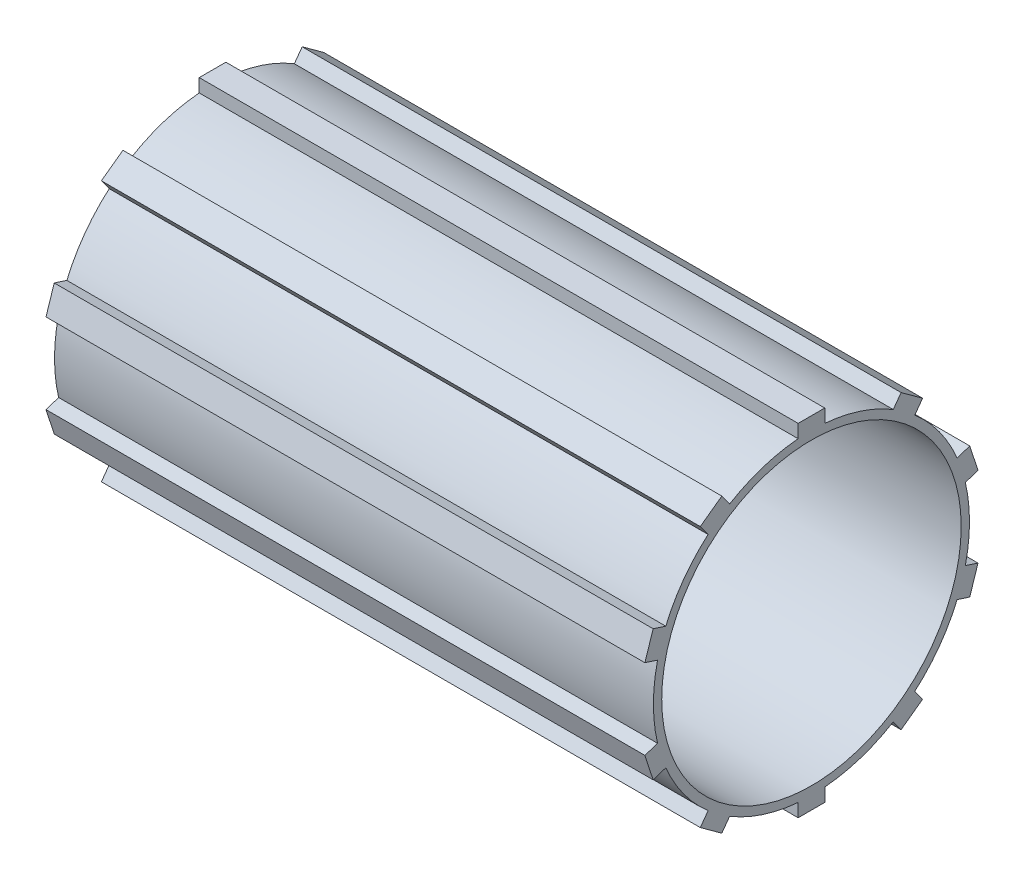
ISO-10303-21;
HEADER;
FILE_DESCRIPTION(('STEP AP214'),'2;1');
FILE_NAME('part.step','',(''),(''),'','','');
FILE_SCHEMA(('AUTOMOTIVE_DESIGN { 1 0 10303 214 1 1 1 1 }'));
ENDSEC;
DATA;
#1=APPLICATION_CONTEXT('core data for automotive mechanical design processes');
#2=APPLICATION_PROTOCOL_DEFINITION('international standard','automotive_design',2000,#1);
#3=PRODUCT_CONTEXT('',#1,'mechanical');
#4=PRODUCT('Part','Part','',(#3));
#5=PRODUCT_RELATED_PRODUCT_CATEGORY('part','',(#4));
#6=PRODUCT_DEFINITION_FORMATION('','',#4);
#7=PRODUCT_DEFINITION_CONTEXT('part definition',#1,'design');
#8=PRODUCT_DEFINITION('design','',#6,#7);
#9=PRODUCT_DEFINITION_SHAPE('','',#8);
#10=(LENGTH_UNIT() NAMED_UNIT(*) SI_UNIT(.MILLI.,.METRE.));
#11=(NAMED_UNIT(*) PLANE_ANGLE_UNIT() SI_UNIT($,.RADIAN.));
#12=(NAMED_UNIT(*) SI_UNIT($,.STERADIAN.) SOLID_ANGLE_UNIT());
#13=UNCERTAINTY_MEASURE_WITH_UNIT(LENGTH_MEASURE(1.E-05),#10,'distance_accuracy_value','');
#14=(GEOMETRIC_REPRESENTATION_CONTEXT(3) GLOBAL_UNCERTAINTY_ASSIGNED_CONTEXT((#13)) GLOBAL_UNIT_ASSIGNED_CONTEXT((#10,
#11,#12)) REPRESENTATION_CONTEXT('',''));
#15=CARTESIAN_POINT('',(0.,0.,0.));
#16=DIRECTION('',(0.,0.,1.));
#17=DIRECTION('',(1.,0.,0.));
#18=AXIS2_PLACEMENT_3D('',#15,#16,#17);
#19=CARTESIAN_POINT('',(90.,0.,0.));
#20=DIRECTION('',(-1.,0.,0.));
#21=DIRECTION('',(0.,0.,1.));
#22=AXIS2_PLACEMENT_3D('',#19,#20,#21);
#23=CYLINDRICAL_SURFACE('',#22,23.75);
#24=DIRECTION('',(-1.,0.,0.));
#25=VECTOR('',#24,1.);
#26=CARTESIAN_POINT('',(90.,20.3214751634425,-12.2922799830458));
#27=LINE('',#26,#25);
#28=CARTESIAN_POINT('',(90.,20.3214751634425,-12.2922799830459));
#29=VERTEX_POINT('',#28);
#30=CARTESIAN_POINT('',(0.,20.3214751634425,-12.2922799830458));
#31=VERTEX_POINT('',#30);
#32=EDGE_CURVE('E341',#29,#31,#27,.T.);
#33=ORIENTED_EDGE('',*,*,#32,.T.);
#34=CARTESIAN_POINT('',(0.,0.,0.));
#35=DIRECTION('',(1.,0.,0.));
#36=DIRECTION('',(0.,0.,-1.));
#37=AXIS2_PLACEMENT_3D('',#34,#35,#36);
#38=CIRCLE('',#37,23.75);
#39=CARTESIAN_POINT('',(0.,23.6656396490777,-2.));
#40=VERTEX_POINT('',#39);
#41=EDGE_CURVE('E690',#31,#40,#38,.T.);
#42=ORIENTED_EDGE('',*,*,#41,.T.);
#43=DIRECTION('',(-1.,0.,0.));
#44=VECTOR('',#43,1.);
#45=CARTESIAN_POINT('',(90.,23.6656396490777,-2.));
#46=LINE('',#45,#44);
#47=CARTESIAN_POINT('',(90.,23.6656396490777,-2.));
#48=VERTEX_POINT('',#47);
#49=EDGE_CURVE('E677',#48,#40,#46,.T.);
#50=ORIENTED_EDGE('',*,*,#49,.F.);
#51=CARTESIAN_POINT('',(90.,0.,0.));
#52=DIRECTION('',(1.,0.,0.));
#53=DIRECTION('',(0.,0.,-1.));
#54=AXIS2_PLACEMENT_3D('',#51,#52,#53);
#55=CIRCLE('',#54,23.75);
#56=EDGE_CURVE('E50',#29,#48,#55,.T.);
#57=ORIENTED_EDGE('',*,*,#56,.F.);
#58=EDGE_LOOP('',(#33,#42,#50,#57));
#59=FACE_BOUND('',#58,.T.);
#60=ADVANCED_FACE('F39',(#59),#23,.T.);
#61=CARTESIAN_POINT('',(0.,9.21519786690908,-21.8893268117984));
#62=VERTEX_POINT('',#61);
#63=CARTESIAN_POINT('',(0.,17.9703341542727,-15.5283479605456));
#64=VERTEX_POINT('',#63);
#65=EDGE_CURVE('E750',#62,#64,#38,.T.);
#66=ORIENTED_EDGE('',*,*,#65,.T.);
#67=DIRECTION('',(-1.,0.,0.));
#68=VECTOR('',#67,1.);
#69=CARTESIAN_POINT('',(90.,17.9703341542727,-15.5283479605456));
#70=LINE('',#69,#68);
#71=CARTESIAN_POINT('',(90.,17.9703341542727,-15.5283479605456));
#72=VERTEX_POINT('',#71);
#73=EDGE_CURVE('E64',#72,#64,#70,.T.);
#74=ORIENTED_EDGE('',*,*,#73,.F.);
#75=CARTESIAN_POINT('',(90.,9.2151978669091,-21.8893268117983));
#76=VERTEX_POINT('',#75);
#77=EDGE_CURVE('E318',#76,#72,#55,.T.);
#78=ORIENTED_EDGE('',*,*,#77,.F.);
#79=DIRECTION('',(-1.,0.,0.));
#80=VECTOR('',#79,1.);
#81=CARTESIAN_POINT('',(90.,9.21519786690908,-21.8893268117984));
#82=LINE('',#81,#80);
#83=EDGE_CURVE('E377',#76,#62,#82,.T.);
#84=ORIENTED_EDGE('',*,*,#83,.T.);
#85=EDGE_LOOP('',(#66,#74,#78,#84));
#86=FACE_BOUND('',#85,.T.);
#87=ADVANCED_FACE('F712',(#86),#23,.T.);
#88=CARTESIAN_POINT('',(0.,-5.4109718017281,-23.1253947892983));
#89=VERTEX_POINT('',#88);
#90=CARTESIAN_POINT('',(0.,5.41097180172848,-23.1253947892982));
#91=VERTEX_POINT('',#90);
#92=EDGE_CURVE('E872',#89,#91,#38,.T.);
#93=ORIENTED_EDGE('',*,*,#92,.T.);
#94=DIRECTION('',(-1.,0.,0.));
#95=VECTOR('',#94,1.);
#96=CARTESIAN_POINT('',(90.,5.41097180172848,-23.1253947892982));
#97=LINE('',#96,#95);
#98=CARTESIAN_POINT('',(90.,5.41097180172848,-23.1253947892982));
#99=VERTEX_POINT('',#98);
#100=EDGE_CURVE('E373',#99,#91,#97,.T.);
#101=ORIENTED_EDGE('',*,*,#100,.F.);
#102=CARTESIAN_POINT('',(90.,-5.41097180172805,-23.1253947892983));
#103=VERTEX_POINT('',#102);
#104=EDGE_CURVE('E757',#103,#99,#55,.T.);
#105=ORIENTED_EDGE('',*,*,#104,.F.);
#106=DIRECTION('',(-1.,0.,0.));
#107=VECTOR('',#106,1.);
#108=CARTESIAN_POINT('',(90.,-5.4109718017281,-23.1253947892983));
#109=LINE('',#108,#107);
#110=EDGE_CURVE('E415',#103,#89,#109,.T.);
#111=ORIENTED_EDGE('',*,*,#110,.T.);
#112=EDGE_LOOP('',(#93,#101,#105,#111));
#113=FACE_BOUND('',#112,.T.);
#114=ADVANCED_FACE('F716',(#113),#23,.T.);
#115=CARTESIAN_POINT('',(0.,-17.9703341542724,-15.5283479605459));
#116=VERTEX_POINT('',#115);
#117=CARTESIAN_POINT('',(0.,-9.21519786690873,-21.8893268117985));
#118=VERTEX_POINT('',#117);
#119=EDGE_CURVE('E858',#116,#118,#38,.T.);
#120=ORIENTED_EDGE('',*,*,#119,.T.);
#121=DIRECTION('',(-1.,0.,0.));
#122=VECTOR('',#121,1.);
#123=CARTESIAN_POINT('',(90.,-9.21519786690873,-21.8893268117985));
#124=LINE('',#123,#122);
#125=CARTESIAN_POINT('',(90.,-9.21519786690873,-21.8893268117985));
#126=VERTEX_POINT('',#125);
#127=EDGE_CURVE('E411',#126,#118,#124,.T.);
#128=ORIENTED_EDGE('',*,*,#127,.F.);
#129=CARTESIAN_POINT('',(90.,-17.9703341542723,-15.528347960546));
#130=VERTEX_POINT('',#129);
#131=EDGE_CURVE('E760',#130,#126,#55,.T.);
#132=ORIENTED_EDGE('',*,*,#131,.F.);
#133=DIRECTION('',(-1.,0.,0.));
#134=VECTOR('',#133,1.);
#135=CARTESIAN_POINT('',(90.,-17.9703341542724,-15.5283479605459));
#136=LINE('',#135,#134);
#137=EDGE_CURVE('E453',#130,#116,#136,.T.);
#138=ORIENTED_EDGE('',*,*,#137,.T.);
#139=EDGE_LOOP('',(#120,#128,#132,#138));
#140=FACE_BOUND('',#139,.T.);
#141=ADVANCED_FACE('F857',(#140),#23,.T.);
#142=CARTESIAN_POINT('',(0.,-23.6656396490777,-2.00000000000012));
#143=VERTEX_POINT('',#142);
#144=CARTESIAN_POINT('',(0.,-20.3214751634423,-12.2922799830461));
#145=VERTEX_POINT('',#144);
#146=EDGE_CURVE('E843',#143,#145,#38,.T.);
#147=ORIENTED_EDGE('',*,*,#146,.T.);
#148=DIRECTION('',(-1.,0.,0.));
#149=VECTOR('',#148,1.);
#150=CARTESIAN_POINT('',(90.,-20.3214751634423,-12.2922799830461));
#151=LINE('',#150,#149);
#152=CARTESIAN_POINT('',(90.,-20.3214751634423,-12.2922799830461));
#153=VERTEX_POINT('',#152);
#154=EDGE_CURVE('E449',#153,#145,#151,.T.);
#155=ORIENTED_EDGE('',*,*,#154,.F.);
#156=CARTESIAN_POINT('',(90.,-23.6656396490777,-2.00000000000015));
#157=VERTEX_POINT('',#156);
#158=EDGE_CURVE('E764',#157,#153,#55,.T.);
#159=ORIENTED_EDGE('',*,*,#158,.F.);
#160=DIRECTION('',(-1.,0.,0.));
#161=VECTOR('',#160,1.);
#162=CARTESIAN_POINT('',(90.,-23.6656396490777,-2.00000000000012));
#163=LINE('',#162,#161);
#164=EDGE_CURVE('E491',#157,#143,#163,.T.);
#165=ORIENTED_EDGE('',*,*,#164,.T.);
#166=EDGE_LOOP('',(#147,#155,#159,#165));
#167=FACE_BOUND('',#166,.T.);
#168=ADVANCED_FACE('F842',(#167),#23,.T.);
#169=CARTESIAN_POINT('',(0.,-20.3214751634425,12.2922799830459));
#170=VERTEX_POINT('',#169);
#171=CARTESIAN_POINT('',(0.,-23.6656396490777,1.99999999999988));
#172=VERTEX_POINT('',#171);
#173=EDGE_CURVE('E828',#170,#172,#38,.T.);
#174=ORIENTED_EDGE('',*,*,#173,.T.);
#175=DIRECTION('',(-1.,0.,0.));
#176=VECTOR('',#175,1.);
#177=CARTESIAN_POINT('',(90.,-23.6656396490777,1.99999999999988));
#178=LINE('',#177,#176);
#179=CARTESIAN_POINT('',(90.,-23.6656396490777,1.99999999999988));
#180=VERTEX_POINT('',#179);
#181=EDGE_CURVE('E487',#180,#172,#178,.T.);
#182=ORIENTED_EDGE('',*,*,#181,.F.);
#183=CARTESIAN_POINT('',(90.,-20.3214751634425,12.2922799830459));
#184=VERTEX_POINT('',#183);
#185=EDGE_CURVE('E768',#184,#180,#55,.T.);
#186=ORIENTED_EDGE('',*,*,#185,.F.);
#187=DIRECTION('',(-1.,0.,0.));
#188=VECTOR('',#187,1.);
#189=CARTESIAN_POINT('',(90.,-20.3214751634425,12.2922799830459));
#190=LINE('',#189,#188);
#191=EDGE_CURVE('E529',#184,#170,#190,.T.);
#192=ORIENTED_EDGE('',*,*,#191,.T.);
#193=EDGE_LOOP('',(#174,#182,#186,#192));
#194=FACE_BOUND('',#193,.T.);
#195=ADVANCED_FACE('F827',(#194),#23,.T.);
#196=CARTESIAN_POINT('',(0.,-9.21519786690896,21.8893268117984));
#197=VERTEX_POINT('',#196);
#198=CARTESIAN_POINT('',(0.,-17.9703341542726,15.5283479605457));
#199=VERTEX_POINT('',#198);
#200=EDGE_CURVE('E813',#197,#199,#38,.T.);
#201=ORIENTED_EDGE('',*,*,#200,.T.);
#202=DIRECTION('',(-1.,0.,0.));
#203=VECTOR('',#202,1.);
#204=CARTESIAN_POINT('',(90.,-17.9703341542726,15.5283479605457));
#205=LINE('',#204,#203);
#206=CARTESIAN_POINT('',(90.,-17.9703341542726,15.5283479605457));
#207=VERTEX_POINT('',#206);
#208=EDGE_CURVE('E525',#207,#199,#205,.T.);
#209=ORIENTED_EDGE('',*,*,#208,.F.);
#210=CARTESIAN_POINT('',(90.,-9.21519786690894,21.8893268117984));
#211=VERTEX_POINT('',#210);
#212=EDGE_CURVE('E772',#211,#207,#55,.T.);
#213=ORIENTED_EDGE('',*,*,#212,.F.);
#214=DIRECTION('',(-1.,0.,0.));
#215=VECTOR('',#214,1.);
#216=CARTESIAN_POINT('',(90.,-9.21519786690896,21.8893268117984));
#217=LINE('',#216,#215);
#218=EDGE_CURVE('E567',#211,#197,#217,.T.);
#219=ORIENTED_EDGE('',*,*,#218,.T.);
#220=EDGE_LOOP('',(#201,#209,#213,#219));
#221=FACE_BOUND('',#220,.T.);
#222=ADVANCED_FACE('F812',(#221),#23,.T.);
#223=CARTESIAN_POINT('',(0.,5.41097180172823,23.1253947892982));
#224=VERTEX_POINT('',#223);
#225=CARTESIAN_POINT('',(0.,-5.41097180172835,23.1253947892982));
#226=VERTEX_POINT('',#225);
#227=EDGE_CURVE('E798',#224,#226,#38,.T.);
#228=ORIENTED_EDGE('',*,*,#227,.T.);
#229=DIRECTION('',(-1.,0.,0.));
#230=VECTOR('',#229,1.);
#231=CARTESIAN_POINT('',(90.,-5.41097180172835,23.1253947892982));
#232=LINE('',#231,#230);
#233=CARTESIAN_POINT('',(90.,-5.41097180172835,23.1253947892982));
#234=VERTEX_POINT('',#233);
#235=EDGE_CURVE('E563',#234,#226,#232,.T.);
#236=ORIENTED_EDGE('',*,*,#235,.F.);
#237=CARTESIAN_POINT('',(90.,5.41097180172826,23.1253947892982));
#238=VERTEX_POINT('',#237);
#239=EDGE_CURVE('E776',#238,#234,#55,.T.);
#240=ORIENTED_EDGE('',*,*,#239,.F.);
#241=DIRECTION('',(-1.,0.,0.));
#242=VECTOR('',#241,1.);
#243=CARTESIAN_POINT('',(90.,5.41097180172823,23.1253947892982));
#244=LINE('',#243,#242);
#245=EDGE_CURVE('E605',#238,#224,#244,.T.);
#246=ORIENTED_EDGE('',*,*,#245,.T.);
#247=EDGE_LOOP('',(#228,#236,#240,#246));
#248=FACE_BOUND('',#247,.T.);
#249=ADVANCED_FACE('F724',(#248),#23,.T.);
#250=CARTESIAN_POINT('',(0.,17.9703341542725,15.5283479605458));
#251=VERTEX_POINT('',#250);
#252=CARTESIAN_POINT('',(0.,9.21519786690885,21.8893268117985));
#253=VERTEX_POINT('',#252);
#254=EDGE_CURVE('E729',#251,#253,#38,.T.);
#255=ORIENTED_EDGE('',*,*,#254,.T.);
#256=DIRECTION('',(-1.,0.,0.));
#257=VECTOR('',#256,1.);
#258=CARTESIAN_POINT('',(90.,9.21519786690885,21.8893268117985));
#259=LINE('',#258,#257);
#260=CARTESIAN_POINT('',(90.,9.21519786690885,21.8893268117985));
#261=VERTEX_POINT('',#260);
#262=EDGE_CURVE('E601',#261,#253,#259,.T.);
#263=ORIENTED_EDGE('',*,*,#262,.F.);
#264=CARTESIAN_POINT('',(90.,17.9703341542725,15.5283479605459));
#265=VERTEX_POINT('',#264);
#266=EDGE_CURVE('E49',#265,#261,#55,.T.);
#267=ORIENTED_EDGE('',*,*,#266,.F.);
#268=DIRECTION('',(-1.,0.,0.));
#269=VECTOR('',#268,1.);
#270=CARTESIAN_POINT('',(90.,17.9703341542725,15.5283479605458));
#271=LINE('',#270,#269);
#272=EDGE_CURVE('E643',#265,#251,#271,.T.);
#273=ORIENTED_EDGE('',*,*,#272,.T.);
#274=EDGE_LOOP('',(#255,#263,#267,#273));
#275=FACE_BOUND('',#274,.T.);
#276=ADVANCED_FACE('F718',(#275),#23,.T.);
#277=CARTESIAN_POINT('',(0.,23.6656396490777,2.));
#278=VERTEX_POINT('',#277);
#279=CARTESIAN_POINT('',(0.,20.3214751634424,12.292279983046));
#280=VERTEX_POINT('',#279);
#281=EDGE_CURVE('E43',#278,#280,#38,.T.);
#282=ORIENTED_EDGE('',*,*,#281,.T.);
#283=DIRECTION('',(-1.,0.,0.));
#284=VECTOR('',#283,1.);
#285=CARTESIAN_POINT('',(90.,20.3214751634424,12.292279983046));
#286=LINE('',#285,#284);
#287=CARTESIAN_POINT('',(90.,20.3214751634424,12.292279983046));
#288=VERTEX_POINT('',#287);
#289=EDGE_CURVE('E639',#288,#280,#286,.T.);
#290=ORIENTED_EDGE('',*,*,#289,.F.);
#291=CARTESIAN_POINT('',(90.,23.6656396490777,2.00000000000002));
#292=VERTEX_POINT('',#291);
#293=EDGE_CURVE('E11',#292,#288,#55,.T.);
#294=ORIENTED_EDGE('',*,*,#293,.F.);
#295=DIRECTION('',(-1.,0.,0.));
#296=VECTOR('',#295,1.);
#297=CARTESIAN_POINT('',(90.,23.6656396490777,2.));
#298=LINE('',#297,#296);
#299=EDGE_CURVE('E681',#292,#278,#298,.T.);
#300=ORIENTED_EDGE('',*,*,#299,.T.);
#301=EDGE_LOOP('',(#282,#290,#294,#300));
#302=FACE_BOUND('',#301,.T.);
#303=ADVANCED_FACE('F41',(#302),#23,.T.);
#304=CARTESIAN_POINT('',(90.,0.,0.));
#305=DIRECTION('',(1.,0.,0.));
#306=DIRECTION('',(0.,0.,-1.));
#307=AXIS2_PLACEMENT_3D('',#304,#305,#306);
#308=PLANE('',#307);
#309=ORIENTED_EDGE('',*,*,#77,.T.);
#310=DIRECTION('',(0.,-0.809016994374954,0.587785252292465));
#311=VECTOR('',#310,1.);
#312=CARTESIAN_POINT('',(90.,19.5883681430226,-16.7039184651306));
#313=LINE('',#312,#311);
#314=CARTESIAN_POINT('',(90.,19.5883681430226,-16.7039184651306));
#315=VERTEX_POINT('',#314);
#316=EDGE_CURVE('E302',#315,#72,#313,.T.);
#317=ORIENTED_EDGE('',*,*,#316,.F.);
#318=DIRECTION('',(0.,-0.587785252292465,-0.809016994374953));
#319=VECTOR('',#318,1.);
#320=CARTESIAN_POINT('',(90.,21.9395091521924,-13.4678504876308));
#321=LINE('',#320,#319);
#322=CARTESIAN_POINT('',(90.,21.9395091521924,-13.4678504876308));
#323=VERTEX_POINT('',#322);
#324=EDGE_CURVE('E316',#323,#315,#321,.T.);
#325=ORIENTED_EDGE('',*,*,#324,.F.);
#326=DIRECTION('',(0.,-0.809016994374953,0.587785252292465));
#327=VECTOR('',#326,1.);
#328=CARTESIAN_POINT('',(90.,21.9395091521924,-13.4678504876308));
#329=LINE('',#328,#327);
#330=EDGE_CURVE('E320',#323,#29,#329,.T.);
#331=ORIENTED_EDGE('',*,*,#330,.T.);
#332=ORIENTED_EDGE('',*,*,#56,.T.);
#333=DIRECTION('',(0.,-1.,0.));
#334=VECTOR('',#333,1.);
#335=CARTESIAN_POINT('',(90.,25.6656396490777,-2.));
#336=LINE('',#335,#334);
#337=CARTESIAN_POINT('',(90.,25.6656396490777,-2.));
#338=VERTEX_POINT('',#337);
#339=EDGE_CURVE('E652',#338,#48,#336,.T.);
#340=ORIENTED_EDGE('',*,*,#339,.F.);
#341=DIRECTION('',(0.,0.,-1.));
#342=VECTOR('',#341,1.);
#343=CARTESIAN_POINT('',(90.,25.6656396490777,2.));
#344=LINE('',#343,#342);
#345=CARTESIAN_POINT('',(90.,25.6656396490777,2.));
#346=VERTEX_POINT('',#345);
#347=EDGE_CURVE('E657',#346,#338,#344,.T.);
#348=ORIENTED_EDGE('',*,*,#347,.F.);
#349=DIRECTION('',(0.,-1.,0.));
#350=VECTOR('',#349,1.);
#351=CARTESIAN_POINT('',(90.,25.6656396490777,2.));
#352=LINE('',#351,#350);
#353=EDGE_CURVE('E648',#346,#292,#352,.T.);
#354=ORIENTED_EDGE('',*,*,#353,.T.);
#355=ORIENTED_EDGE('',*,*,#293,.T.);
#356=DIRECTION('',(0.,-0.809016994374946,-0.587785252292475));
#357=VECTOR('',#356,1.);
#358=CARTESIAN_POINT('',(90.,21.9395091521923,13.467850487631));
#359=LINE('',#358,#357);
#360=CARTESIAN_POINT('',(90.,21.9395091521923,13.467850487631));
#361=VERTEX_POINT('',#360);
#362=EDGE_CURVE('E614',#361,#288,#359,.T.);
#363=ORIENTED_EDGE('',*,*,#362,.F.);
#364=DIRECTION('',(0.,0.587785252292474,-0.809016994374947));
#365=VECTOR('',#364,1.);
#366=CARTESIAN_POINT('',(90.,19.5883681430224,16.7039184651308));
#367=LINE('',#366,#365);
#368=CARTESIAN_POINT('',(90.,19.5883681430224,16.7039184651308));
#369=VERTEX_POINT('',#368);
#370=EDGE_CURVE('E619',#369,#361,#367,.T.);
#371=ORIENTED_EDGE('',*,*,#370,.F.);
#372=DIRECTION('',(0.,-0.809016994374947,-0.587785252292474));
#373=VECTOR('',#372,1.);
#374=CARTESIAN_POINT('',(90.,19.5883681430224,16.7039184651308));
#375=LINE('',#374,#373);
#376=EDGE_CURVE('E610',#369,#265,#375,.T.);
#377=ORIENTED_EDGE('',*,*,#376,.T.);
#378=ORIENTED_EDGE('',*,*,#266,.T.);
#379=DIRECTION('',(0.,-0.309016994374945,-0.951056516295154));
#380=VECTOR('',#379,1.);
#381=CARTESIAN_POINT('',(90.,9.83323185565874,23.7914398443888));
#382=LINE('',#381,#380);
#383=CARTESIAN_POINT('',(90.,9.83323185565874,23.7914398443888));
#384=VERTEX_POINT('',#383);
#385=EDGE_CURVE('E576',#384,#261,#382,.T.);
#386=ORIENTED_EDGE('',*,*,#385,.F.);
#387=DIRECTION('',(0.,0.951056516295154,-0.309016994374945));
#388=VECTOR('',#387,1.);
#389=CARTESIAN_POINT('',(90.,6.02900579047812,25.0275078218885));
#390=LINE('',#389,#388);
#391=CARTESIAN_POINT('',(90.,6.02900579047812,25.0275078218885));
#392=VERTEX_POINT('',#391);
#393=EDGE_CURVE('E581',#392,#384,#390,.T.);
#394=ORIENTED_EDGE('',*,*,#393,.F.);
#395=DIRECTION('',(0.,-0.309016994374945,-0.951056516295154));
#396=VECTOR('',#395,1.);
#397=CARTESIAN_POINT('',(90.,6.02900579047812,25.0275078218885));
#398=LINE('',#397,#396);
#399=EDGE_CURVE('E572',#392,#238,#398,.T.);
#400=ORIENTED_EDGE('',*,*,#399,.T.);
#401=ORIENTED_EDGE('',*,*,#239,.T.);
#402=DIRECTION('',(0.,0.309016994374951,-0.951056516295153));
#403=VECTOR('',#402,1.);
#404=CARTESIAN_POINT('',(90.,-6.02900579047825,25.0275078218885));
#405=LINE('',#404,#403);
#406=CARTESIAN_POINT('',(90.,-6.02900579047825,25.0275078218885));
#407=VERTEX_POINT('',#406);
#408=EDGE_CURVE('E538',#407,#234,#405,.T.);
#409=ORIENTED_EDGE('',*,*,#408,.F.);
#410=DIRECTION('',(0.,0.951056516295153,0.309016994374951));
#411=VECTOR('',#410,1.);
#412=CARTESIAN_POINT('',(90.,-9.83323185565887,23.7914398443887));
#413=LINE('',#412,#411);
#414=CARTESIAN_POINT('',(90.,-9.83323185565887,23.7914398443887));
#415=VERTEX_POINT('',#414);
#416=EDGE_CURVE('E543',#415,#407,#413,.T.);
#417=ORIENTED_EDGE('',*,*,#416,.F.);
#418=DIRECTION('',(0.,0.309016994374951,-0.951056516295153));
#419=VECTOR('',#418,1.);
#420=CARTESIAN_POINT('',(90.,-9.83323185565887,23.7914398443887));
#421=LINE('',#420,#419);
#422=EDGE_CURVE('E534',#415,#211,#421,.T.);
#423=ORIENTED_EDGE('',*,*,#422,.T.);
#424=ORIENTED_EDGE('',*,*,#212,.T.);
#425=DIRECTION('',(0.,0.80901699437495,-0.587785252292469));
#426=VECTOR('',#425,1.);
#427=CARTESIAN_POINT('',(90.,-19.5883681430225,16.7039184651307));
#428=LINE('',#427,#426);
#429=CARTESIAN_POINT('',(90.,-19.5883681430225,16.7039184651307));
#430=VERTEX_POINT('',#429);
#431=EDGE_CURVE('E500',#430,#207,#428,.T.);
#432=ORIENTED_EDGE('',*,*,#431,.F.);
#433=DIRECTION('',(0.,0.58778525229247,0.80901699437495));
#434=VECTOR('',#433,1.);
#435=CARTESIAN_POINT('',(90.,-21.9395091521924,13.4678504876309));
#436=LINE('',#435,#434);
#437=CARTESIAN_POINT('',(90.,-21.9395091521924,13.4678504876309));
#438=VERTEX_POINT('',#437);
#439=EDGE_CURVE('E505',#438,#430,#436,.T.);
#440=ORIENTED_EDGE('',*,*,#439,.F.);
#441=DIRECTION('',(0.,0.80901699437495,-0.587785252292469));
#442=VECTOR('',#441,1.);
#443=CARTESIAN_POINT('',(90.,-21.9395091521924,13.4678504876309));
#444=LINE('',#443,#442);
#445=EDGE_CURVE('E496',#438,#184,#444,.T.);
#446=ORIENTED_EDGE('',*,*,#445,.T.);
#447=ORIENTED_EDGE('',*,*,#185,.T.);
#448=DIRECTION('',(0.,1.,0.));
#449=VECTOR('',#448,1.);
#450=CARTESIAN_POINT('',(90.,-25.6656396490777,1.99999999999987));
#451=LINE('',#450,#449);
#452=CARTESIAN_POINT('',(90.,-25.6656396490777,1.99999999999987));
#453=VERTEX_POINT('',#452);
#454=EDGE_CURVE('E462',#453,#180,#451,.T.);
#455=ORIENTED_EDGE('',*,*,#454,.F.);
#456=DIRECTION('',(0.,0.,1.));
#457=VECTOR('',#456,1.);
#458=CARTESIAN_POINT('',(90.,-25.6656396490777,-2.00000000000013));
#459=LINE('',#458,#457);
#460=CARTESIAN_POINT('',(90.,-25.6656396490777,-2.00000000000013));
#461=VERTEX_POINT('',#460);
#462=EDGE_CURVE('E467',#461,#453,#459,.T.);
#463=ORIENTED_EDGE('',*,*,#462,.F.);
#464=DIRECTION('',(0.,1.,0.));
#465=VECTOR('',#464,1.);
#466=CARTESIAN_POINT('',(90.,-25.6656396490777,-2.00000000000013));
#467=LINE('',#466,#465);
#468=EDGE_CURVE('E458',#461,#157,#467,.T.);
#469=ORIENTED_EDGE('',*,*,#468,.T.);
#470=ORIENTED_EDGE('',*,*,#158,.T.);
#471=DIRECTION('',(0.,0.809016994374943,0.587785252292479));
#472=VECTOR('',#471,1.);
#473=CARTESIAN_POINT('',(90.,-21.9395091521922,-13.4678504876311));
#474=LINE('',#473,#472);
#475=CARTESIAN_POINT('',(90.,-21.9395091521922,-13.4678504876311));
#476=VERTEX_POINT('',#475);
#477=EDGE_CURVE('E424',#476,#153,#474,.T.);
#478=ORIENTED_EDGE('',*,*,#477,.F.);
#479=DIRECTION('',(0.,-0.587785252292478,0.809016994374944));
#480=VECTOR('',#479,1.);
#481=CARTESIAN_POINT('',(90.,-19.5883681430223,-16.7039184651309));
#482=LINE('',#481,#480);
#483=CARTESIAN_POINT('',(90.,-19.5883681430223,-16.7039184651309));
#484=VERTEX_POINT('',#483);
#485=EDGE_CURVE('E429',#484,#476,#482,.T.);
#486=ORIENTED_EDGE('',*,*,#485,.F.);
#487=DIRECTION('',(0.,0.809016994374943,0.587785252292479));
#488=VECTOR('',#487,1.);
#489=CARTESIAN_POINT('',(90.,-19.5883681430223,-16.7039184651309));
#490=LINE('',#489,#488);
#491=EDGE_CURVE('E420',#484,#130,#490,.T.);
#492=ORIENTED_EDGE('',*,*,#491,.T.);
#493=ORIENTED_EDGE('',*,*,#131,.T.);
#494=DIRECTION('',(0.,0.309016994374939,0.951056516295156));
#495=VECTOR('',#494,1.);
#496=CARTESIAN_POINT('',(90.,-9.83323185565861,-23.7914398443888));
#497=LINE('',#496,#495);
#498=CARTESIAN_POINT('',(90.,-9.83323185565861,-23.7914398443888));
#499=VERTEX_POINT('',#498);
#500=EDGE_CURVE('E386',#499,#126,#497,.T.);
#501=ORIENTED_EDGE('',*,*,#500,.F.);
#502=DIRECTION('',(0.,-0.951056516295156,0.30901699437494));
#503=VECTOR('',#502,1.);
#504=CARTESIAN_POINT('',(90.,-6.02900579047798,-25.0275078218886));
#505=LINE('',#504,#503);
#506=CARTESIAN_POINT('',(90.,-6.02900579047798,-25.0275078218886));
#507=VERTEX_POINT('',#506);
#508=EDGE_CURVE('E391',#507,#499,#505,.T.);
#509=ORIENTED_EDGE('',*,*,#508,.F.);
#510=DIRECTION('',(0.,0.30901699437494,0.951056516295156));
#511=VECTOR('',#510,1.);
#512=CARTESIAN_POINT('',(90.,-6.02900579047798,-25.0275078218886));
#513=LINE('',#512,#511);
#514=EDGE_CURVE('E382',#507,#103,#513,.T.);
#515=ORIENTED_EDGE('',*,*,#514,.T.);
#516=ORIENTED_EDGE('',*,*,#104,.T.);
#517=DIRECTION('',(0.,-0.309016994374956,0.951056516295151));
#518=VECTOR('',#517,1.);
#519=CARTESIAN_POINT('',(90.,6.02900579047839,-25.0275078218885));
#520=LINE('',#519,#518);
#521=CARTESIAN_POINT('',(90.,6.02900579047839,-25.0275078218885));
#522=VERTEX_POINT('',#521);
#523=EDGE_CURVE('E348',#522,#99,#520,.T.);
#524=ORIENTED_EDGE('',*,*,#523,.F.);
#525=DIRECTION('',(0.,-0.951056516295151,-0.309016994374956));
#526=VECTOR('',#525,1.);
#527=CARTESIAN_POINT('',(90.,9.83323185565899,-23.7914398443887));
#528=LINE('',#527,#526);
#529=CARTESIAN_POINT('',(90.,9.83323185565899,-23.7914398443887));
#530=VERTEX_POINT('',#529);
#531=EDGE_CURVE('E353',#530,#522,#528,.T.);
#532=ORIENTED_EDGE('',*,*,#531,.F.);
#533=DIRECTION('',(0.,-0.309016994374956,0.951056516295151));
#534=VECTOR('',#533,1.);
#535=CARTESIAN_POINT('',(90.,9.83323185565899,-23.7914398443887));
#536=LINE('',#535,#534);
#537=EDGE_CURVE('E345',#530,#76,#536,.T.);
#538=ORIENTED_EDGE('',*,*,#537,.T.);
#539=EDGE_LOOP('',(#309,#317,#325,#331,#332,#340,#348,#354,#355,#363,#371,#377,#378,#386,#394,
#400,#401,#409,#417,#423,#424,#432,#440,#446,#447,#455,#463,#469,#470,#478,#486,#492,#493,#501,
#509,#515,#516,#524,#532,#538));
#540=FACE_BOUND('',#539,.T.);
#541=CARTESIAN_POINT('',(90.,0.,0.));
#542=DIRECTION('',(1.,0.,0.));
#543=DIRECTION('',(0.,0.,-1.));
#544=AXIS2_PLACEMENT_3D('',#541,#542,#543);
#545=CIRCLE('',#544,22.5);
#546=CARTESIAN_POINT('',(90.,0.,22.5));
#547=VERTEX_POINT('',#546);
#548=EDGE_CURVE('E686',#547,#547,#545,.T.);
#549=ORIENTED_EDGE('',*,*,#548,.F.);
#550=EDGE_LOOP('',(#549));
#551=FACE_BOUND('',#550,.T.);
#552=ADVANCED_FACE('F314',(#540,#551),#308,.T.);
#553=CARTESIAN_POINT('',(0.,0.,0.));
#554=DIRECTION('',(1.,0.,0.));
#555=DIRECTION('',(0.,0.,-1.));
#556=AXIS2_PLACEMENT_3D('',#553,#554,#555);
#557=PLANE('',#556);
#558=ORIENTED_EDGE('',*,*,#41,.F.);
#559=DIRECTION('',(0.,-0.809016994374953,0.587785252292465));
#560=VECTOR('',#559,1.);
#561=CARTESIAN_POINT('',(0.,21.9395091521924,-13.4678504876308));
#562=LINE('',#561,#560);
#563=CARTESIAN_POINT('',(0.,21.9395091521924,-13.4678504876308));
#564=VERTEX_POINT('',#563);
#565=EDGE_CURVE('E330',#564,#31,#562,.T.);
#566=ORIENTED_EDGE('',*,*,#565,.F.);
#567=DIRECTION('',(0.,-0.587785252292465,-0.809016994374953));
#568=VECTOR('',#567,1.);
#569=CARTESIAN_POINT('',(0.,21.9395091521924,-13.4678504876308));
#570=LINE('',#569,#568);
#571=CARTESIAN_POINT('',(0.,19.5883681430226,-16.7039184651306));
#572=VERTEX_POINT('',#571);
#573=EDGE_CURVE('E336',#564,#572,#570,.T.);
#574=ORIENTED_EDGE('',*,*,#573,.T.);
#575=DIRECTION('',(0.,-0.809016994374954,0.587785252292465));
#576=VECTOR('',#575,1.);
#577=CARTESIAN_POINT('',(0.,19.5883681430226,-16.7039184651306));
#578=LINE('',#577,#576);
#579=EDGE_CURVE('E304',#572,#64,#578,.T.);
#580=ORIENTED_EDGE('',*,*,#579,.T.);
#581=ORIENTED_EDGE('',*,*,#65,.F.);
#582=DIRECTION('',(0.,-0.309016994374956,0.951056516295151));
#583=VECTOR('',#582,1.);
#584=CARTESIAN_POINT('',(0.,9.83323185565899,-23.7914398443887));
#585=LINE('',#584,#583);
#586=CARTESIAN_POINT('',(0.,9.83323185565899,-23.7914398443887));
#587=VERTEX_POINT('',#586);
#588=EDGE_CURVE('E344',#587,#62,#585,.T.);
#589=ORIENTED_EDGE('',*,*,#588,.F.);
#590=DIRECTION('',(0.,-0.951056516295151,-0.309016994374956));
#591=VECTOR('',#590,1.);
#592=CARTESIAN_POINT('',(0.,9.83323185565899,-23.7914398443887));
#593=LINE('',#592,#591);
#594=CARTESIAN_POINT('',(0.,6.02900579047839,-25.0275078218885));
#595=VERTEX_POINT('',#594);
#596=EDGE_CURVE('E349',#587,#595,#593,.T.);
#597=ORIENTED_EDGE('',*,*,#596,.T.);
#598=DIRECTION('',(0.,-0.309016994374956,0.951056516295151));
#599=VECTOR('',#598,1.);
#600=CARTESIAN_POINT('',(0.,6.02900579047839,-25.0275078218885));
#601=LINE('',#600,#599);
#602=EDGE_CURVE('E361',#595,#91,#601,.T.);
#603=ORIENTED_EDGE('',*,*,#602,.T.);
#604=ORIENTED_EDGE('',*,*,#92,.F.);
#605=DIRECTION('',(0.,0.30901699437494,0.951056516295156));
#606=VECTOR('',#605,1.);
#607=CARTESIAN_POINT('',(0.,-6.02900579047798,-25.0275078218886));
#608=LINE('',#607,#606);
#609=CARTESIAN_POINT('',(0.,-6.02900579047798,-25.0275078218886));
#610=VERTEX_POINT('',#609);
#611=EDGE_CURVE('E381',#610,#89,#608,.T.);
#612=ORIENTED_EDGE('',*,*,#611,.F.);
#613=DIRECTION('',(0.,-0.951056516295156,0.30901699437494));
#614=VECTOR('',#613,1.);
#615=CARTESIAN_POINT('',(0.,-6.02900579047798,-25.0275078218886));
#616=LINE('',#615,#614);
#617=CARTESIAN_POINT('',(0.,-9.83323185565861,-23.7914398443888));
#618=VERTEX_POINT('',#617);
#619=EDGE_CURVE('E387',#610,#618,#616,.T.);
#620=ORIENTED_EDGE('',*,*,#619,.T.);
#621=DIRECTION('',(0.,0.309016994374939,0.951056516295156));
#622=VECTOR('',#621,1.);
#623=CARTESIAN_POINT('',(0.,-9.83323185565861,-23.7914398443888));
#624=LINE('',#623,#622);
#625=EDGE_CURVE('E399',#618,#118,#624,.T.);
#626=ORIENTED_EDGE('',*,*,#625,.T.);
#627=ORIENTED_EDGE('',*,*,#119,.F.);
#628=DIRECTION('',(0.,0.809016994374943,0.587785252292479));
#629=VECTOR('',#628,1.);
#630=CARTESIAN_POINT('',(0.,-19.5883681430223,-16.7039184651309));
#631=LINE('',#630,#629);
#632=CARTESIAN_POINT('',(0.,-19.5883681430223,-16.7039184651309));
#633=VERTEX_POINT('',#632);
#634=EDGE_CURVE('E419',#633,#116,#631,.T.);
#635=ORIENTED_EDGE('',*,*,#634,.F.);
#636=DIRECTION('',(0.,-0.587785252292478,0.809016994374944));
#637=VECTOR('',#636,1.);
#638=CARTESIAN_POINT('',(0.,-19.5883681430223,-16.7039184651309));
#639=LINE('',#638,#637);
#640=CARTESIAN_POINT('',(0.,-21.9395091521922,-13.4678504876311));
#641=VERTEX_POINT('',#640);
#642=EDGE_CURVE('E425',#633,#641,#639,.T.);
#643=ORIENTED_EDGE('',*,*,#642,.T.);
#644=DIRECTION('',(0.,0.809016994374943,0.587785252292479));
#645=VECTOR('',#644,1.);
#646=CARTESIAN_POINT('',(0.,-21.9395091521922,-13.4678504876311));
#647=LINE('',#646,#645);
#648=EDGE_CURVE('E437',#641,#145,#647,.T.);
#649=ORIENTED_EDGE('',*,*,#648,.T.);
#650=ORIENTED_EDGE('',*,*,#146,.F.);
#651=DIRECTION('',(0.,1.,0.));
#652=VECTOR('',#651,1.);
#653=CARTESIAN_POINT('',(0.,-25.6656396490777,-2.00000000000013));
#654=LINE('',#653,#652);
#655=CARTESIAN_POINT('',(0.,-25.6656396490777,-2.00000000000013));
#656=VERTEX_POINT('',#655);
#657=EDGE_CURVE('E457',#656,#143,#654,.T.);
#658=ORIENTED_EDGE('',*,*,#657,.F.);
#659=DIRECTION('',(0.,0.,1.));
#660=VECTOR('',#659,1.);
#661=CARTESIAN_POINT('',(0.,-25.6656396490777,-2.00000000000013));
#662=LINE('',#661,#660);
#663=CARTESIAN_POINT('',(0.,-25.6656396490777,1.99999999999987));
#664=VERTEX_POINT('',#663);
#665=EDGE_CURVE('E463',#656,#664,#662,.T.);
#666=ORIENTED_EDGE('',*,*,#665,.T.);
#667=DIRECTION('',(0.,1.,0.));
#668=VECTOR('',#667,1.);
#669=CARTESIAN_POINT('',(0.,-25.6656396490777,1.99999999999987));
#670=LINE('',#669,#668);
#671=EDGE_CURVE('E475',#664,#172,#670,.T.);
#672=ORIENTED_EDGE('',*,*,#671,.T.);
#673=ORIENTED_EDGE('',*,*,#173,.F.);
#674=DIRECTION('',(0.,0.80901699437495,-0.587785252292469));
#675=VECTOR('',#674,1.);
#676=CARTESIAN_POINT('',(0.,-21.9395091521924,13.4678504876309));
#677=LINE('',#676,#675);
#678=CARTESIAN_POINT('',(0.,-21.9395091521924,13.4678504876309));
#679=VERTEX_POINT('',#678);
#680=EDGE_CURVE('E495',#679,#170,#677,.T.);
#681=ORIENTED_EDGE('',*,*,#680,.F.);
#682=DIRECTION('',(0.,0.58778525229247,0.80901699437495));
#683=VECTOR('',#682,1.);
#684=CARTESIAN_POINT('',(0.,-21.9395091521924,13.4678504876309));
#685=LINE('',#684,#683);
#686=CARTESIAN_POINT('',(0.,-19.5883681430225,16.7039184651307));
#687=VERTEX_POINT('',#686);
#688=EDGE_CURVE('E501',#679,#687,#685,.T.);
#689=ORIENTED_EDGE('',*,*,#688,.T.);
#690=DIRECTION('',(0.,0.80901699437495,-0.587785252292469));
#691=VECTOR('',#690,1.);
#692=CARTESIAN_POINT('',(0.,-19.5883681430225,16.7039184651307));
#693=LINE('',#692,#691);
#694=EDGE_CURVE('E513',#687,#199,#693,.T.);
#695=ORIENTED_EDGE('',*,*,#694,.T.);
#696=ORIENTED_EDGE('',*,*,#200,.F.);
#697=DIRECTION('',(0.,0.309016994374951,-0.951056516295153));
#698=VECTOR('',#697,1.);
#699=CARTESIAN_POINT('',(0.,-9.83323185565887,23.7914398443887));
#700=LINE('',#699,#698);
#701=CARTESIAN_POINT('',(0.,-9.83323185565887,23.7914398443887));
#702=VERTEX_POINT('',#701);
#703=EDGE_CURVE('E533',#702,#197,#700,.T.);
#704=ORIENTED_EDGE('',*,*,#703,.F.);
#705=DIRECTION('',(0.,0.951056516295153,0.309016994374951));
#706=VECTOR('',#705,1.);
#707=CARTESIAN_POINT('',(0.,-9.83323185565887,23.7914398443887));
#708=LINE('',#707,#706);
#709=CARTESIAN_POINT('',(0.,-6.02900579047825,25.0275078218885));
#710=VERTEX_POINT('',#709);
#711=EDGE_CURVE('E539',#702,#710,#708,.T.);
#712=ORIENTED_EDGE('',*,*,#711,.T.);
#713=DIRECTION('',(0.,0.309016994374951,-0.951056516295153));
#714=VECTOR('',#713,1.);
#715=CARTESIAN_POINT('',(0.,-6.02900579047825,25.0275078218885));
#716=LINE('',#715,#714);
#717=EDGE_CURVE('E551',#710,#226,#716,.T.);
#718=ORIENTED_EDGE('',*,*,#717,.T.);
#719=ORIENTED_EDGE('',*,*,#227,.F.);
#720=DIRECTION('',(0.,-0.309016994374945,-0.951056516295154));
#721=VECTOR('',#720,1.);
#722=CARTESIAN_POINT('',(0.,6.02900579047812,25.0275078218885));
#723=LINE('',#722,#721);
#724=CARTESIAN_POINT('',(0.,6.02900579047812,25.0275078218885));
#725=VERTEX_POINT('',#724);
#726=EDGE_CURVE('E571',#725,#224,#723,.T.);
#727=ORIENTED_EDGE('',*,*,#726,.F.);
#728=DIRECTION('',(0.,0.951056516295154,-0.309016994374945));
#729=VECTOR('',#728,1.);
#730=CARTESIAN_POINT('',(0.,6.02900579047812,25.0275078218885));
#731=LINE('',#730,#729);
#732=CARTESIAN_POINT('',(0.,9.83323185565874,23.7914398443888));
#733=VERTEX_POINT('',#732);
#734=EDGE_CURVE('E577',#725,#733,#731,.T.);
#735=ORIENTED_EDGE('',*,*,#734,.T.);
#736=DIRECTION('',(0.,-0.309016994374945,-0.951056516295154));
#737=VECTOR('',#736,1.);
#738=CARTESIAN_POINT('',(0.,9.83323185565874,23.7914398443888));
#739=LINE('',#738,#737);
#740=EDGE_CURVE('E589',#733,#253,#739,.T.);
#741=ORIENTED_EDGE('',*,*,#740,.T.);
#742=ORIENTED_EDGE('',*,*,#254,.F.);
#743=DIRECTION('',(0.,-0.809016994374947,-0.587785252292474));
#744=VECTOR('',#743,1.);
#745=CARTESIAN_POINT('',(0.,19.5883681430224,16.7039184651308));
#746=LINE('',#745,#744);
#747=CARTESIAN_POINT('',(0.,19.5883681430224,16.7039184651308));
#748=VERTEX_POINT('',#747);
#749=EDGE_CURVE('E609',#748,#251,#746,.T.);
#750=ORIENTED_EDGE('',*,*,#749,.F.);
#751=DIRECTION('',(0.,0.587785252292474,-0.809016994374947));
#752=VECTOR('',#751,1.);
#753=CARTESIAN_POINT('',(0.,19.5883681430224,16.7039184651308));
#754=LINE('',#753,#752);
#755=CARTESIAN_POINT('',(0.,21.9395091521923,13.467850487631));
#756=VERTEX_POINT('',#755);
#757=EDGE_CURVE('E615',#748,#756,#754,.T.);
#758=ORIENTED_EDGE('',*,*,#757,.T.);
#759=DIRECTION('',(0.,-0.809016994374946,-0.587785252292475));
#760=VECTOR('',#759,1.);
#761=CARTESIAN_POINT('',(0.,21.9395091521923,13.467850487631));
#762=LINE('',#761,#760);
#763=EDGE_CURVE('E627',#756,#280,#762,.T.);
#764=ORIENTED_EDGE('',*,*,#763,.T.);
#765=ORIENTED_EDGE('',*,*,#281,.F.);
#766=DIRECTION('',(0.,-1.,0.));
#767=VECTOR('',#766,1.);
#768=CARTESIAN_POINT('',(0.,25.6656396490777,2.));
#769=LINE('',#768,#767);
#770=CARTESIAN_POINT('',(0.,25.6656396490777,2.));
#771=VERTEX_POINT('',#770);
#772=EDGE_CURVE('E647',#771,#278,#769,.T.);
#773=ORIENTED_EDGE('',*,*,#772,.F.);
#774=DIRECTION('',(0.,0.,-1.));
#775=VECTOR('',#774,1.);
#776=CARTESIAN_POINT('',(0.,25.6656396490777,2.));
#777=LINE('',#776,#775);
#778=CARTESIAN_POINT('',(0.,25.6656396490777,-2.));
#779=VERTEX_POINT('',#778);
#780=EDGE_CURVE('E653',#771,#779,#777,.T.);
#781=ORIENTED_EDGE('',*,*,#780,.T.);
#782=DIRECTION('',(0.,-1.,0.));
#783=VECTOR('',#782,1.);
#784=CARTESIAN_POINT('',(0.,25.6656396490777,-2.));
#785=LINE('',#784,#783);
#786=EDGE_CURVE('E665',#779,#40,#785,.T.);
#787=ORIENTED_EDGE('',*,*,#786,.T.);
#788=EDGE_LOOP('',(#558,#566,#574,#580,#581,#589,#597,#603,#604,#612,#620,#626,#627,#635,#643,
#649,#650,#658,#666,#672,#673,#681,#689,#695,#696,#704,#712,#718,#719,#727,#735,#741,#742,#750,
#758,#764,#765,#773,#781,#787));
#789=FACE_BOUND('',#788,.T.);
#790=CARTESIAN_POINT('',(0.,0.,0.));
#791=DIRECTION('',(1.,0.,0.));
#792=DIRECTION('',(0.,0.,-1.));
#793=AXIS2_PLACEMENT_3D('',#790,#791,#792);
#794=CIRCLE('',#793,22.5);
#795=CARTESIAN_POINT('',(0.,0.,22.5));
#796=VERTEX_POINT('',#795);
#797=EDGE_CURVE('E685',#796,#796,#794,.T.);
#798=ORIENTED_EDGE('',*,*,#797,.T.);
#799=EDGE_LOOP('',(#798));
#800=FACE_BOUND('',#799,.T.);
#801=ADVANCED_FACE('F695',(#789,#800),#557,.F.);
#802=CARTESIAN_POINT('',(90.,0.,0.));
#803=DIRECTION('',(-1.,0.,0.));
#804=DIRECTION('',(0.,0.,1.));
#805=AXIS2_PLACEMENT_3D('',#802,#803,#804);
#806=CYLINDRICAL_SURFACE('',#805,22.5);
#807=CARTESIAN_POINT('',(90.,0.,22.5));
#808=CARTESIAN_POINT('',(89.0625,0.,22.5));
#809=CARTESIAN_POINT('',(88.125,0.,22.5));
#810=CARTESIAN_POINT('',(86.25,0.,22.5));
#811=CARTESIAN_POINT('',(85.3125,0.,22.5));
#812=CARTESIAN_POINT('',(83.4375,0.,22.5));
#813=CARTESIAN_POINT('',(82.5,0.,22.5));
#814=CARTESIAN_POINT('',(80.625,0.,22.5));
#815=CARTESIAN_POINT('',(79.6875,0.,22.5));
#816=CARTESIAN_POINT('',(77.8125,0.,22.5));
#817=CARTESIAN_POINT('',(76.875,0.,22.5));
#818=CARTESIAN_POINT('',(75.,0.,22.5));
#819=CARTESIAN_POINT('',(74.0625,0.,22.5));
#820=CARTESIAN_POINT('',(72.1875,0.,22.5));
#821=CARTESIAN_POINT('',(71.25,0.,22.5));
#822=CARTESIAN_POINT('',(69.375,0.,22.5));
#823=CARTESIAN_POINT('',(68.4375,0.,22.5));
#824=CARTESIAN_POINT('',(66.5625,0.,22.5));
#825=CARTESIAN_POINT('',(65.625,0.,22.5));
#826=CARTESIAN_POINT('',(63.75,0.,22.5));
#827=CARTESIAN_POINT('',(62.8125,0.,22.5));
#828=CARTESIAN_POINT('',(60.9375,0.,22.5));
#829=CARTESIAN_POINT('',(60.,0.,22.5));
#830=CARTESIAN_POINT('',(58.125,0.,22.5));
#831=CARTESIAN_POINT('',(57.1875,0.,22.5));
#832=CARTESIAN_POINT('',(55.3125,0.,22.5));
#833=CARTESIAN_POINT('',(54.375,0.,22.5));
#834=CARTESIAN_POINT('',(52.5,0.,22.5));
#835=CARTESIAN_POINT('',(51.5625,0.,22.5));
#836=CARTESIAN_POINT('',(49.6875,0.,22.5));
#837=CARTESIAN_POINT('',(48.75,0.,22.5));
#838=CARTESIAN_POINT('',(46.875,0.,22.5));
#839=CARTESIAN_POINT('',(45.9375,0.,22.5));
#840=CARTESIAN_POINT('',(44.0625,0.,22.5));
#841=CARTESIAN_POINT('',(43.125,0.,22.5));
#842=CARTESIAN_POINT('',(41.25,0.,22.5));
#843=CARTESIAN_POINT('',(40.3125,0.,22.5));
#844=CARTESIAN_POINT('',(38.4375,0.,22.5));
#845=CARTESIAN_POINT('',(37.5,0.,22.5));
#846=CARTESIAN_POINT('',(35.625,0.,22.5));
#847=CARTESIAN_POINT('',(34.6875,0.,22.5));
#848=CARTESIAN_POINT('',(32.8125,0.,22.5));
#849=CARTESIAN_POINT('',(31.875,0.,22.5));
#850=CARTESIAN_POINT('',(30.,0.,22.5));
#851=CARTESIAN_POINT('',(29.0625,0.,22.5));
#852=CARTESIAN_POINT('',(27.1875,0.,22.5));
#853=CARTESIAN_POINT('',(26.25,0.,22.5));
#854=CARTESIAN_POINT('',(24.375,0.,22.5));
#855=CARTESIAN_POINT('',(23.4375,0.,22.5));
#856=CARTESIAN_POINT('',(21.5625,0.,22.5));
#857=CARTESIAN_POINT('',(20.625,0.,22.5));
#858=CARTESIAN_POINT('',(18.75,0.,22.5));
#859=CARTESIAN_POINT('',(17.8125,0.,22.5));
#860=CARTESIAN_POINT('',(15.9375,0.,22.5));
#861=CARTESIAN_POINT('',(15.,0.,22.5));
#862=CARTESIAN_POINT('',(13.125,0.,22.5));
#863=CARTESIAN_POINT('',(12.1875,0.,22.5));
#864=CARTESIAN_POINT('',(10.3125,0.,22.5));
#865=CARTESIAN_POINT('',(9.37499999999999,0.,22.5));
#866=CARTESIAN_POINT('',(7.49999999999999,0.,22.5));
#867=CARTESIAN_POINT('',(6.56249999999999,0.,22.5));
#868=CARTESIAN_POINT('',(4.68749999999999,0.,22.5));
#869=CARTESIAN_POINT('',(3.74999999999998,0.,22.5));
#870=CARTESIAN_POINT('',(1.87499999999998,0.,22.5));
#871=CARTESIAN_POINT('',(0.937499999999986,0.,22.5));
#872=CARTESIAN_POINT('',(0.,0.,22.5));
#873=B_SPLINE_CURVE_WITH_KNOTS('',3,(#807,#808,#809,#810,#811,#812,#813,#814,#815,#816,#817,
#818,#819,#820,#821,#822,#823,#824,#825,#826,#827,#828,#829,#830,#831,#832,#833,#834,#835,#836,
#837,#838,#839,#840,#841,#842,#843,#844,#845,#846,#847,#848,#849,#850,#851,#852,#853,#854,#855,
#856,#857,#858,#859,#860,#861,#862,#863,#864,#865,#866,#867,#868,#869,#870,#871,#872),
.UNSPECIFIED.,.F.,.F.,(4,2,2,2,2,2,2,2,2,2,2,2,2,2,2,2,2,2,2,2,2,2,2,2,2,2,2,2,2,2,2,2,4),(0.,
2.8125,5.62499999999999,8.43749999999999,11.25,14.0625,16.875,19.6875,22.5,25.3125,28.125,
30.9375,33.75,36.5625,39.375,42.1875,45.,47.8125,50.625,53.4375,56.25,59.0625,61.875,64.6875,
67.5,70.3125,73.125,75.9375,78.75,81.5625,84.375,87.1875,90.),.UNSPECIFIED.);
#874=EDGE_CURVE('BSEAM697',#547,#796,#873,.T.);
#875=ORIENTED_EDGE('',*,*,#548,.T.);
#876=ORIENTED_EDGE('',*,*,#797,.F.);
#877=ORIENTED_EDGE('',*,*,#874,.T.);
#878=ORIENTED_EDGE('',*,*,#874,.F.);
#879=EDGE_LOOP('',(#875,#877,#876,#878));
#880=FACE_BOUND('',#879,.T.);
#881=ADVANCED_FACE('F697',(#880),#806,.F.);
#882=CARTESIAN_POINT('',(90.,25.6656396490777,2.));
#883=DIRECTION('',(0.,0.,-1.));
#884=DIRECTION('',(0.,1.,0.));
#885=AXIS2_PLACEMENT_3D('',#882,#883,#884);
#886=PLANE('',#885);
#887=ORIENTED_EDGE('',*,*,#772,.T.);
#888=ORIENTED_EDGE('',*,*,#299,.F.);
#889=ORIENTED_EDGE('',*,*,#353,.F.);
#890=DIRECTION('',(-1.,0.,0.));
#891=VECTOR('',#890,1.);
#892=CARTESIAN_POINT('',(90.,25.6656396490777,2.));
#893=LINE('',#892,#891);
#894=EDGE_CURVE('E661',#346,#771,#893,.T.);
#895=ORIENTED_EDGE('',*,*,#894,.T.);
#896=EDGE_LOOP('',(#887,#888,#889,#895));
#897=FACE_BOUND('',#896,.T.);
#898=ADVANCED_FACE('F699',(#897),#886,.F.);
#899=CARTESIAN_POINT('',(90.,25.6656396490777,-2.));
#900=DIRECTION('',(0.,0.,-1.));
#901=DIRECTION('',(0.,1.,0.));
#902=AXIS2_PLACEMENT_3D('',#899,#900,#901);
#903=PLANE('',#902);
#904=ORIENTED_EDGE('',*,*,#786,.F.);
#905=DIRECTION('',(-1.,0.,0.));
#906=VECTOR('',#905,1.);
#907=CARTESIAN_POINT('',(90.,25.6656396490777,-2.));
#908=LINE('',#907,#906);
#909=EDGE_CURVE('E674',#338,#779,#908,.T.);
#910=ORIENTED_EDGE('',*,*,#909,.F.);
#911=ORIENTED_EDGE('',*,*,#339,.T.);
#912=ORIENTED_EDGE('',*,*,#49,.T.);
#913=EDGE_LOOP('',(#904,#910,#911,#912));
#914=FACE_BOUND('',#913,.T.);
#915=ADVANCED_FACE('F706',(#914),#903,.T.);
#916=CARTESIAN_POINT('',(90.,25.6656396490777,2.));
#917=DIRECTION('',(0.,1.,0.));
#918=DIRECTION('',(0.,0.,1.));
#919=AXIS2_PLACEMENT_3D('',#916,#917,#918);
#920=PLANE('',#919);
#921=ORIENTED_EDGE('',*,*,#780,.F.);
#922=ORIENTED_EDGE('',*,*,#894,.F.);
#923=ORIENTED_EDGE('',*,*,#347,.T.);
#924=ORIENTED_EDGE('',*,*,#909,.T.);
#925=EDGE_LOOP('',(#921,#922,#923,#924));
#926=FACE_BOUND('',#925,.T.);
#927=ADVANCED_FACE('F745',(#926),#920,.T.);
#928=CARTESIAN_POINT('',(90.,19.5883681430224,16.7039184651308));
#929=DIRECTION('',(0.,0.587785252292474,-0.809016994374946));
#930=DIRECTION('',(0.,0.809016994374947,0.587785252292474));
#931=AXIS2_PLACEMENT_3D('',#928,#929,#930);
#932=PLANE('',#931);
#933=ORIENTED_EDGE('',*,*,#749,.T.);
#934=ORIENTED_EDGE('',*,*,#272,.F.);
#935=ORIENTED_EDGE('',*,*,#376,.F.);
#936=DIRECTION('',(-1.,0.,0.));
#937=VECTOR('',#936,1.);
#938=CARTESIAN_POINT('',(90.,19.5883681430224,16.7039184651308));
#939=LINE('',#938,#937);
#940=EDGE_CURVE('E623',#369,#748,#939,.T.);
#941=ORIENTED_EDGE('',*,*,#940,.T.);
#942=EDGE_LOOP('',(#933,#934,#935,#941));
#943=FACE_BOUND('',#942,.T.);
#944=ADVANCED_FACE('F894',(#943),#932,.F.);
#945=CARTESIAN_POINT('',(90.,21.9395091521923,13.467850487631));
#946=DIRECTION('',(0.,0.587785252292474,-0.809016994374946));
#947=DIRECTION('',(0.,0.809016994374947,0.587785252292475));
#948=AXIS2_PLACEMENT_3D('',#945,#946,#947);
#949=PLANE('',#948);
#950=ORIENTED_EDGE('',*,*,#763,.F.);
#951=DIRECTION('',(-1.,0.,0.));
#952=VECTOR('',#951,1.);
#953=CARTESIAN_POINT('',(90.,21.9395091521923,13.467850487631));
#954=LINE('',#953,#952);
#955=EDGE_CURVE('E636',#361,#756,#954,.T.);
#956=ORIENTED_EDGE('',*,*,#955,.F.);
#957=ORIENTED_EDGE('',*,*,#362,.T.);
#958=ORIENTED_EDGE('',*,*,#289,.T.);
#959=EDGE_LOOP('',(#950,#956,#957,#958));
#960=FACE_BOUND('',#959,.T.);
#961=ADVANCED_FACE('F732',(#960),#949,.T.);
#962=CARTESIAN_POINT('',(90.,19.5883681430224,16.7039184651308));
#963=DIRECTION('',(0.,0.809016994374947,0.587785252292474));
#964=DIRECTION('',(0.,-0.587785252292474,0.809016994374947));
#965=AXIS2_PLACEMENT_3D('',#962,#963,#964);
#966=PLANE('',#965);
#967=ORIENTED_EDGE('',*,*,#757,.F.);
#968=ORIENTED_EDGE('',*,*,#940,.F.);
#969=ORIENTED_EDGE('',*,*,#370,.T.);
#970=ORIENTED_EDGE('',*,*,#955,.T.);
#971=EDGE_LOOP('',(#967,#968,#969,#970));
#972=FACE_BOUND('',#971,.T.);
#973=ADVANCED_FACE('F737',(#972),#966,.T.);
#974=CARTESIAN_POINT('',(90.,6.02900579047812,25.0275078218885));
#975=DIRECTION('',(0.,0.951056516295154,-0.309016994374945));
#976=DIRECTION('',(0.,0.309016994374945,0.951056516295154));
#977=AXIS2_PLACEMENT_3D('',#974,#975,#976);
#978=PLANE('',#977);
#979=ORIENTED_EDGE('',*,*,#726,.T.);
#980=ORIENTED_EDGE('',*,*,#245,.F.);
#981=ORIENTED_EDGE('',*,*,#399,.F.);
#982=DIRECTION('',(-1.,0.,0.));
#983=VECTOR('',#982,1.);
#984=CARTESIAN_POINT('',(90.,6.02900579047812,25.0275078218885));
#985=LINE('',#984,#983);
#986=EDGE_CURVE('E585',#392,#725,#985,.T.);
#987=ORIENTED_EDGE('',*,*,#986,.T.);
#988=EDGE_LOOP('',(#979,#980,#981,#987));
#989=FACE_BOUND('',#988,.T.);
#990=ADVANCED_FACE('F795',(#989),#978,.F.);
#991=CARTESIAN_POINT('',(90.,9.83323185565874,23.7914398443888));
#992=DIRECTION('',(0.,0.951056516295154,-0.309016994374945));
#993=DIRECTION('',(0.,0.309016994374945,0.951056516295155));
#994=AXIS2_PLACEMENT_3D('',#991,#992,#993);
#995=PLANE('',#994);
#996=ORIENTED_EDGE('',*,*,#740,.F.);
#997=DIRECTION('',(-1.,0.,0.));
#998=VECTOR('',#997,1.);
#999=CARTESIAN_POINT('',(90.,9.83323185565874,23.7914398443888));
#1000=LINE('',#999,#998);
#1001=EDGE_CURVE('E598',#384,#733,#1000,.T.);
#1002=ORIENTED_EDGE('',*,*,#1001,.F.);
#1003=ORIENTED_EDGE('',*,*,#385,.T.);
#1004=ORIENTED_EDGE('',*,*,#262,.T.);
#1005=EDGE_LOOP('',(#996,#1002,#1003,#1004));
#1006=FACE_BOUND('',#1005,.T.);
#1007=ADVANCED_FACE('F788',(#1006),#995,.T.);
#1008=CARTESIAN_POINT('',(90.,6.02900579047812,25.0275078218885));
#1009=DIRECTION('',(0.,0.309016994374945,0.951056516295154));
#1010=DIRECTION('',(0.,-0.951056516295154,0.309016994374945));
#1011=AXIS2_PLACEMENT_3D('',#1008,#1009,#1010);
#1012=PLANE('',#1011);
#1013=ORIENTED_EDGE('',*,*,#734,.F.);
#1014=ORIENTED_EDGE('',*,*,#986,.F.);
#1015=ORIENTED_EDGE('',*,*,#393,.T.);
#1016=ORIENTED_EDGE('',*,*,#1001,.T.);
#1017=EDGE_LOOP('',(#1013,#1014,#1015,#1016));
#1018=FACE_BOUND('',#1017,.T.);
#1019=ADVANCED_FACE('F791',(#1018),#1012,.T.);
#1020=CARTESIAN_POINT('',(90.,-9.83323185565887,23.7914398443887));
#1021=DIRECTION('',(0.,0.951056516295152,0.309016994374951));
#1022=DIRECTION('',(0.,-0.309016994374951,0.951056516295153));
#1023=AXIS2_PLACEMENT_3D('',#1020,#1021,#1022);
#1024=PLANE('',#1023);
#1025=ORIENTED_EDGE('',*,*,#703,.T.);
#1026=ORIENTED_EDGE('',*,*,#218,.F.);
#1027=ORIENTED_EDGE('',*,*,#422,.F.);
#1028=DIRECTION('',(-1.,0.,0.));
#1029=VECTOR('',#1028,1.);
#1030=CARTESIAN_POINT('',(90.,-9.83323185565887,23.7914398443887));
#1031=LINE('',#1030,#1029);
#1032=EDGE_CURVE('E547',#415,#702,#1031,.T.);
#1033=ORIENTED_EDGE('',*,*,#1032,.T.);
#1034=EDGE_LOOP('',(#1025,#1026,#1027,#1033));
#1035=FACE_BOUND('',#1034,.T.);
#1036=ADVANCED_FACE('F810',(#1035),#1024,.F.);
#1037=CARTESIAN_POINT('',(90.,-6.02900579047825,25.0275078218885));
#1038=DIRECTION('',(0.,0.951056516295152,0.309016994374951));
#1039=DIRECTION('',(0.,-0.309016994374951,0.951056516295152));
#1040=AXIS2_PLACEMENT_3D('',#1037,#1038,#1039);
#1041=PLANE('',#1040);
#1042=ORIENTED_EDGE('',*,*,#717,.F.);
#1043=DIRECTION('',(-1.,0.,0.));
#1044=VECTOR('',#1043,1.);
#1045=CARTESIAN_POINT('',(90.,-6.02900579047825,25.0275078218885));
#1046=LINE('',#1045,#1044);
#1047=EDGE_CURVE('E560',#407,#710,#1046,.T.);
#1048=ORIENTED_EDGE('',*,*,#1047,.F.);
#1049=ORIENTED_EDGE('',*,*,#408,.T.);
#1050=ORIENTED_EDGE('',*,*,#235,.T.);
#1051=EDGE_LOOP('',(#1042,#1048,#1049,#1050));
#1052=FACE_BOUND('',#1051,.T.);
#1053=ADVANCED_FACE('F801',(#1052),#1041,.T.);
#1054=CARTESIAN_POINT('',(90.,-9.83323185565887,23.7914398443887));
#1055=DIRECTION('',(0.,-0.309016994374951,0.951056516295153));
#1056=DIRECTION('',(0.,-0.951056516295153,-0.309016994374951));
#1057=AXIS2_PLACEMENT_3D('',#1054,#1055,#1056);
#1058=PLANE('',#1057);
#1059=ORIENTED_EDGE('',*,*,#711,.F.);
#1060=ORIENTED_EDGE('',*,*,#1032,.F.);
#1061=ORIENTED_EDGE('',*,*,#416,.T.);
#1062=ORIENTED_EDGE('',*,*,#1047,.T.);
#1063=EDGE_LOOP('',(#1059,#1060,#1061,#1062));
#1064=FACE_BOUND('',#1063,.T.);
#1065=ADVANCED_FACE('F805',(#1064),#1058,.T.);
#1066=CARTESIAN_POINT('',(90.,-21.9395091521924,13.4678504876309));
#1067=DIRECTION('',(0.,0.587785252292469,0.80901699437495));
#1068=DIRECTION('',(0.,-0.80901699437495,0.587785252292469));
#1069=AXIS2_PLACEMENT_3D('',#1066,#1067,#1068);
#1070=PLANE('',#1069);
#1071=ORIENTED_EDGE('',*,*,#680,.T.);
#1072=ORIENTED_EDGE('',*,*,#191,.F.);
#1073=ORIENTED_EDGE('',*,*,#445,.F.);
#1074=DIRECTION('',(-1.,0.,0.));
#1075=VECTOR('',#1074,1.);
#1076=CARTESIAN_POINT('',(90.,-21.9395091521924,13.4678504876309));
#1077=LINE('',#1076,#1075);
#1078=EDGE_CURVE('E509',#438,#679,#1077,.T.);
#1079=ORIENTED_EDGE('',*,*,#1078,.T.);
#1080=EDGE_LOOP('',(#1071,#1072,#1073,#1079));
#1081=FACE_BOUND('',#1080,.T.);
#1082=ADVANCED_FACE('F825',(#1081),#1070,.F.);
#1083=CARTESIAN_POINT('',(90.,-19.5883681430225,16.7039184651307));
#1084=DIRECTION('',(0.,0.587785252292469,0.80901699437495));
#1085=DIRECTION('',(0.,-0.809016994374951,0.587785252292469));
#1086=AXIS2_PLACEMENT_3D('',#1083,#1084,#1085);
#1087=PLANE('',#1086);
#1088=ORIENTED_EDGE('',*,*,#694,.F.);
#1089=DIRECTION('',(-1.,0.,0.));
#1090=VECTOR('',#1089,1.);
#1091=CARTESIAN_POINT('',(90.,-19.5883681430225,16.7039184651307));
#1092=LINE('',#1091,#1090);
#1093=EDGE_CURVE('E522',#430,#687,#1092,.T.);
#1094=ORIENTED_EDGE('',*,*,#1093,.F.);
#1095=ORIENTED_EDGE('',*,*,#431,.T.);
#1096=ORIENTED_EDGE('',*,*,#208,.T.);
#1097=EDGE_LOOP('',(#1088,#1094,#1095,#1096));
#1098=FACE_BOUND('',#1097,.T.);
#1099=ADVANCED_FACE('F816',(#1098),#1087,.T.);
#1100=CARTESIAN_POINT('',(90.,-21.9395091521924,13.4678504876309));
#1101=DIRECTION('',(0.,-0.80901699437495,0.58778525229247));
#1102=DIRECTION('',(0.,-0.58778525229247,-0.80901699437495));
#1103=AXIS2_PLACEMENT_3D('',#1100,#1101,#1102);
#1104=PLANE('',#1103);
#1105=ORIENTED_EDGE('',*,*,#688,.F.);
#1106=ORIENTED_EDGE('',*,*,#1078,.F.);
#1107=ORIENTED_EDGE('',*,*,#439,.T.);
#1108=ORIENTED_EDGE('',*,*,#1093,.T.);
#1109=EDGE_LOOP('',(#1105,#1106,#1107,#1108));
#1110=FACE_BOUND('',#1109,.T.);
#1111=ADVANCED_FACE('F820',(#1110),#1104,.T.);
#1112=CARTESIAN_POINT('',(90.,-25.6656396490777,-2.00000000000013));
#1113=DIRECTION('',(0.,0.,1.));
#1114=DIRECTION('',(0.,-1.,0.));
#1115=AXIS2_PLACEMENT_3D('',#1112,#1113,#1114);
#1116=PLANE('',#1115);
#1117=ORIENTED_EDGE('',*,*,#657,.T.);
#1118=ORIENTED_EDGE('',*,*,#164,.F.);
#1119=ORIENTED_EDGE('',*,*,#468,.F.);
#1120=DIRECTION('',(-1.,0.,0.));
#1121=VECTOR('',#1120,1.);
#1122=CARTESIAN_POINT('',(90.,-25.6656396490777,-2.00000000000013));
#1123=LINE('',#1122,#1121);
#1124=EDGE_CURVE('E471',#461,#656,#1123,.T.);
#1125=ORIENTED_EDGE('',*,*,#1124,.T.);
#1126=EDGE_LOOP('',(#1117,#1118,#1119,#1125));
#1127=FACE_BOUND('',#1126,.T.);
#1128=ADVANCED_FACE('F840',(#1127),#1116,.F.);
#1129=CARTESIAN_POINT('',(90.,-25.6656396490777,1.99999999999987));
#1130=DIRECTION('',(0.,0.,1.));
#1131=DIRECTION('',(0.,-1.,0.));
#1132=AXIS2_PLACEMENT_3D('',#1129,#1130,#1131);
#1133=PLANE('',#1132);
#1134=ORIENTED_EDGE('',*,*,#671,.F.);
#1135=DIRECTION('',(-1.,0.,0.));
#1136=VECTOR('',#1135,1.);
#1137=CARTESIAN_POINT('',(90.,-25.6656396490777,1.99999999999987));
#1138=LINE('',#1137,#1136);
#1139=EDGE_CURVE('E484',#453,#664,#1138,.T.);
#1140=ORIENTED_EDGE('',*,*,#1139,.F.);
#1141=ORIENTED_EDGE('',*,*,#454,.T.);
#1142=ORIENTED_EDGE('',*,*,#181,.T.);
#1143=EDGE_LOOP('',(#1134,#1140,#1141,#1142));
#1144=FACE_BOUND('',#1143,.T.);
#1145=ADVANCED_FACE('F831',(#1144),#1133,.T.);
#1146=CARTESIAN_POINT('',(90.,-25.6656396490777,-2.00000000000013));
#1147=DIRECTION('',(0.,-1.,0.));
#1148=DIRECTION('',(0.,0.,-1.));
#1149=AXIS2_PLACEMENT_3D('',#1146,#1147,#1148);
#1150=PLANE('',#1149);
#1151=ORIENTED_EDGE('',*,*,#665,.F.);
#1152=ORIENTED_EDGE('',*,*,#1124,.F.);
#1153=ORIENTED_EDGE('',*,*,#462,.T.);
#1154=ORIENTED_EDGE('',*,*,#1139,.T.);
#1155=EDGE_LOOP('',(#1151,#1152,#1153,#1154));
#1156=FACE_BOUND('',#1155,.T.);
#1157=ADVANCED_FACE('F835',(#1156),#1150,.T.);
#1158=CARTESIAN_POINT('',(90.,-19.5883681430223,-16.7039184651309));
#1159=DIRECTION('',(0.,-0.587785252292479,0.809016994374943));
#1160=DIRECTION('',(0.,-0.809016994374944,-0.587785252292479));
#1161=AXIS2_PLACEMENT_3D('',#1158,#1159,#1160);
#1162=PLANE('',#1161);
#1163=ORIENTED_EDGE('',*,*,#634,.T.);
#1164=ORIENTED_EDGE('',*,*,#137,.F.);
#1165=ORIENTED_EDGE('',*,*,#491,.F.);
#1166=DIRECTION('',(-1.,0.,0.));
#1167=VECTOR('',#1166,1.);
#1168=CARTESIAN_POINT('',(90.,-19.5883681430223,-16.7039184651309));
#1169=LINE('',#1168,#1167);
#1170=EDGE_CURVE('E433',#484,#633,#1169,.T.);
#1171=ORIENTED_EDGE('',*,*,#1170,.T.);
#1172=EDGE_LOOP('',(#1163,#1164,#1165,#1171));
#1173=FACE_BOUND('',#1172,.T.);
#1174=ADVANCED_FACE('F855',(#1173),#1162,.F.);
#1175=CARTESIAN_POINT('',(90.,-21.9395091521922,-13.4678504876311));
#1176=DIRECTION('',(0.,-0.587785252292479,0.809016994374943));
#1177=DIRECTION('',(0.,-0.809016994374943,-0.587785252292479));
#1178=AXIS2_PLACEMENT_3D('',#1175,#1176,#1177);
#1179=PLANE('',#1178);
#1180=ORIENTED_EDGE('',*,*,#648,.F.);
#1181=DIRECTION('',(-1.,0.,0.));
#1182=VECTOR('',#1181,1.);
#1183=CARTESIAN_POINT('',(90.,-21.9395091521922,-13.4678504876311));
#1184=LINE('',#1183,#1182);
#1185=EDGE_CURVE('E446',#476,#641,#1184,.T.);
#1186=ORIENTED_EDGE('',*,*,#1185,.F.);
#1187=ORIENTED_EDGE('',*,*,#477,.T.);
#1188=ORIENTED_EDGE('',*,*,#154,.T.);
#1189=EDGE_LOOP('',(#1180,#1186,#1187,#1188));
#1190=FACE_BOUND('',#1189,.T.);
#1191=ADVANCED_FACE('F846',(#1190),#1179,.T.);
#1192=CARTESIAN_POINT('',(90.,-19.5883681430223,-16.7039184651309));
#1193=DIRECTION('',(0.,-0.809016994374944,-0.587785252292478));
#1194=DIRECTION('',(0.,0.587785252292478,-0.809016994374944));
#1195=AXIS2_PLACEMENT_3D('',#1192,#1193,#1194);
#1196=PLANE('',#1195);
#1197=ORIENTED_EDGE('',*,*,#642,.F.);
#1198=ORIENTED_EDGE('',*,*,#1170,.F.);
#1199=ORIENTED_EDGE('',*,*,#485,.T.);
#1200=ORIENTED_EDGE('',*,*,#1185,.T.);
#1201=EDGE_LOOP('',(#1197,#1198,#1199,#1200));
#1202=FACE_BOUND('',#1201,.T.);
#1203=ADVANCED_FACE('F850',(#1202),#1196,.T.);
#1204=CARTESIAN_POINT('',(90.,-6.02900579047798,-25.0275078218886));
#1205=DIRECTION('',(0.,-0.951056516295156,0.30901699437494));
#1206=DIRECTION('',(0.,-0.30901699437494,-0.951056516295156));
#1207=AXIS2_PLACEMENT_3D('',#1204,#1205,#1206);
#1208=PLANE('',#1207);
#1209=ORIENTED_EDGE('',*,*,#611,.T.);
#1210=ORIENTED_EDGE('',*,*,#110,.F.);
#1211=ORIENTED_EDGE('',*,*,#514,.F.);
#1212=DIRECTION('',(-1.,0.,0.));
#1213=VECTOR('',#1212,1.);
#1214=CARTESIAN_POINT('',(90.,-6.02900579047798,-25.0275078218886));
#1215=LINE('',#1214,#1213);
#1216=EDGE_CURVE('E395',#507,#610,#1215,.T.);
#1217=ORIENTED_EDGE('',*,*,#1216,.T.);
#1218=EDGE_LOOP('',(#1209,#1210,#1211,#1217));
#1219=FACE_BOUND('',#1218,.T.);
#1220=ADVANCED_FACE('F870',(#1219),#1208,.F.);
#1221=CARTESIAN_POINT('',(90.,-9.83323185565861,-23.7914398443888));
#1222=DIRECTION('',(0.,-0.951056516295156,0.309016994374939));
#1223=DIRECTION('',(0.,-0.309016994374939,-0.951056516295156));
#1224=AXIS2_PLACEMENT_3D('',#1221,#1222,#1223);
#1225=PLANE('',#1224);
#1226=ORIENTED_EDGE('',*,*,#625,.F.);
#1227=DIRECTION('',(-1.,0.,0.));
#1228=VECTOR('',#1227,1.);
#1229=CARTESIAN_POINT('',(90.,-9.83323185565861,-23.7914398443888));
#1230=LINE('',#1229,#1228);
#1231=EDGE_CURVE('E408',#499,#618,#1230,.T.);
#1232=ORIENTED_EDGE('',*,*,#1231,.F.);
#1233=ORIENTED_EDGE('',*,*,#500,.T.);
#1234=ORIENTED_EDGE('',*,*,#127,.T.);
#1235=EDGE_LOOP('',(#1226,#1232,#1233,#1234));
#1236=FACE_BOUND('',#1235,.T.);
#1237=ADVANCED_FACE('F861',(#1236),#1225,.T.);
#1238=CARTESIAN_POINT('',(90.,-6.02900579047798,-25.0275078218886));
#1239=DIRECTION('',(0.,-0.30901699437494,-0.951056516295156));
#1240=DIRECTION('',(0.,0.951056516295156,-0.30901699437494));
#1241=AXIS2_PLACEMENT_3D('',#1238,#1239,#1240);
#1242=PLANE('',#1241);
#1243=ORIENTED_EDGE('',*,*,#619,.F.);
#1244=ORIENTED_EDGE('',*,*,#1216,.F.);
#1245=ORIENTED_EDGE('',*,*,#508,.T.);
#1246=ORIENTED_EDGE('',*,*,#1231,.T.);
#1247=EDGE_LOOP('',(#1243,#1244,#1245,#1246));
#1248=FACE_BOUND('',#1247,.T.);
#1249=ADVANCED_FACE('F865',(#1248),#1242,.T.);
#1250=CARTESIAN_POINT('',(90.,9.83323185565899,-23.7914398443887));
#1251=DIRECTION('',(0.,-0.951056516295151,-0.309016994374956));
#1252=DIRECTION('',(0.,0.309016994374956,-0.951056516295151));
#1253=AXIS2_PLACEMENT_3D('',#1250,#1251,#1252);
#1254=PLANE('',#1253);
#1255=ORIENTED_EDGE('',*,*,#588,.T.);
#1256=ORIENTED_EDGE('',*,*,#83,.F.);
#1257=ORIENTED_EDGE('',*,*,#537,.F.);
#1258=DIRECTION('',(-1.,0.,0.));
#1259=VECTOR('',#1258,1.);
#1260=CARTESIAN_POINT('',(90.,9.83323185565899,-23.7914398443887));
#1261=LINE('',#1260,#1259);
#1262=EDGE_CURVE('E357',#530,#587,#1261,.T.);
#1263=ORIENTED_EDGE('',*,*,#1262,.T.);
#1264=EDGE_LOOP('',(#1255,#1256,#1257,#1263));
#1265=FACE_BOUND('',#1264,.T.);
#1266=ADVANCED_FACE('F884',(#1265),#1254,.F.);
#1267=CARTESIAN_POINT('',(90.,6.02900579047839,-25.0275078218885));
#1268=DIRECTION('',(0.,-0.951056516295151,-0.309016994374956));
#1269=DIRECTION('',(0.,0.309016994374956,-0.951056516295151));
#1270=AXIS2_PLACEMENT_3D('',#1267,#1268,#1269);
#1271=PLANE('',#1270);
#1272=ORIENTED_EDGE('',*,*,#602,.F.);
#1273=DIRECTION('',(-1.,0.,0.));
#1274=VECTOR('',#1273,1.);
#1275=CARTESIAN_POINT('',(90.,6.02900579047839,-25.0275078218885));
#1276=LINE('',#1275,#1274);
#1277=EDGE_CURVE('E370',#522,#595,#1276,.T.);
#1278=ORIENTED_EDGE('',*,*,#1277,.F.);
#1279=ORIENTED_EDGE('',*,*,#523,.T.);
#1280=ORIENTED_EDGE('',*,*,#100,.T.);
#1281=EDGE_LOOP('',(#1272,#1278,#1279,#1280));
#1282=FACE_BOUND('',#1281,.T.);
#1283=ADVANCED_FACE('F875',(#1282),#1271,.T.);
#1284=CARTESIAN_POINT('',(90.,9.83323185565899,-23.7914398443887));
#1285=DIRECTION('',(0.,0.309016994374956,-0.951056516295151));
#1286=DIRECTION('',(0.,0.951056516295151,0.309016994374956));
#1287=AXIS2_PLACEMENT_3D('',#1284,#1285,#1286);
#1288=PLANE('',#1287);
#1289=ORIENTED_EDGE('',*,*,#596,.F.);
#1290=ORIENTED_EDGE('',*,*,#1262,.F.);
#1291=ORIENTED_EDGE('',*,*,#531,.T.);
#1292=ORIENTED_EDGE('',*,*,#1277,.T.);
#1293=EDGE_LOOP('',(#1289,#1290,#1291,#1292));
#1294=FACE_BOUND('',#1293,.T.);
#1295=ADVANCED_FACE('F879',(#1294),#1288,.T.);
#1296=CARTESIAN_POINT('',(90.,21.9395091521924,-13.4678504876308));
#1297=DIRECTION('',(0.,-0.587785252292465,-0.809016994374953));
#1298=DIRECTION('',(0.,0.809016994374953,-0.587785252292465));
#1299=AXIS2_PLACEMENT_3D('',#1296,#1297,#1298);
#1300=PLANE('',#1299);
#1301=ORIENTED_EDGE('',*,*,#565,.T.);
#1302=ORIENTED_EDGE('',*,*,#32,.F.);
#1303=ORIENTED_EDGE('',*,*,#330,.F.);
#1304=DIRECTION('',(-1.,0.,0.));
#1305=VECTOR('',#1304,1.);
#1306=CARTESIAN_POINT('',(90.,21.9395091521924,-13.4678504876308));
#1307=LINE('',#1306,#1305);
#1308=EDGE_CURVE('E310',#323,#564,#1307,.T.);
#1309=ORIENTED_EDGE('',*,*,#1308,.T.);
#1310=EDGE_LOOP('',(#1301,#1302,#1303,#1309));
#1311=FACE_BOUND('',#1310,.T.);
#1312=ADVANCED_FACE('F753',(#1311),#1300,.F.);
#1313=CARTESIAN_POINT('',(90.,19.5883681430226,-16.7039184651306));
#1314=DIRECTION('',(0.,-0.587785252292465,-0.809016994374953));
#1315=DIRECTION('',(0.,0.809016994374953,-0.587785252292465));
#1316=AXIS2_PLACEMENT_3D('',#1313,#1314,#1315);
#1317=PLANE('',#1316);
#1318=ORIENTED_EDGE('',*,*,#579,.F.);
#1319=DIRECTION('',(-1.,0.,0.));
#1320=VECTOR('',#1319,1.);
#1321=CARTESIAN_POINT('',(90.,19.5883681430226,-16.7039184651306));
#1322=LINE('',#1321,#1320);
#1323=EDGE_CURVE('E299',#315,#572,#1322,.T.);
#1324=ORIENTED_EDGE('',*,*,#1323,.F.);
#1325=ORIENTED_EDGE('',*,*,#316,.T.);
#1326=ORIENTED_EDGE('',*,*,#73,.T.);
#1327=EDGE_LOOP('',(#1318,#1324,#1325,#1326));
#1328=FACE_BOUND('',#1327,.T.);
#1329=ADVANCED_FACE('F301',(#1328),#1317,.T.);
#1330=CARTESIAN_POINT('',(90.,21.9395091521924,-13.4678504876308));
#1331=DIRECTION('',(0.,0.809016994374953,-0.587785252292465));
#1332=DIRECTION('',(0.,0.587785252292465,0.809016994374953));
#1333=AXIS2_PLACEMENT_3D('',#1330,#1331,#1332);
#1334=PLANE('',#1333);
#1335=ORIENTED_EDGE('',*,*,#573,.F.);
#1336=ORIENTED_EDGE('',*,*,#1308,.F.);
#1337=ORIENTED_EDGE('',*,*,#324,.T.);
#1338=ORIENTED_EDGE('',*,*,#1323,.T.);
#1339=EDGE_LOOP('',(#1335,#1336,#1337,#1338));
#1340=FACE_BOUND('',#1339,.T.);
#1341=ADVANCED_FACE('F322',(#1340),#1334,.T.);
#1342=CLOSED_SHELL('',(#60,#87,#114,#141,#168,#195,#222,#249,#276,#303,#552,#801,#881,#898,#915,
#927,#944,#961,#973,#990,#1007,#1019,#1036,#1053,#1065,#1082,#1099,#1111,#1128,#1145,#1157,
#1174,#1191,#1203,#1220,#1237,#1249,#1266,#1283,#1295,#1312,#1329,#1341));
#1343=MANIFOLD_SOLID_BREP('B2',#1342);
#1344=ADVANCED_BREP_SHAPE_REPRESENTATION('',(#18,#1343),#14);
#1345=SHAPE_DEFINITION_REPRESENTATION(#9,#1344);
ENDSEC;
END-ISO-10303-21;
